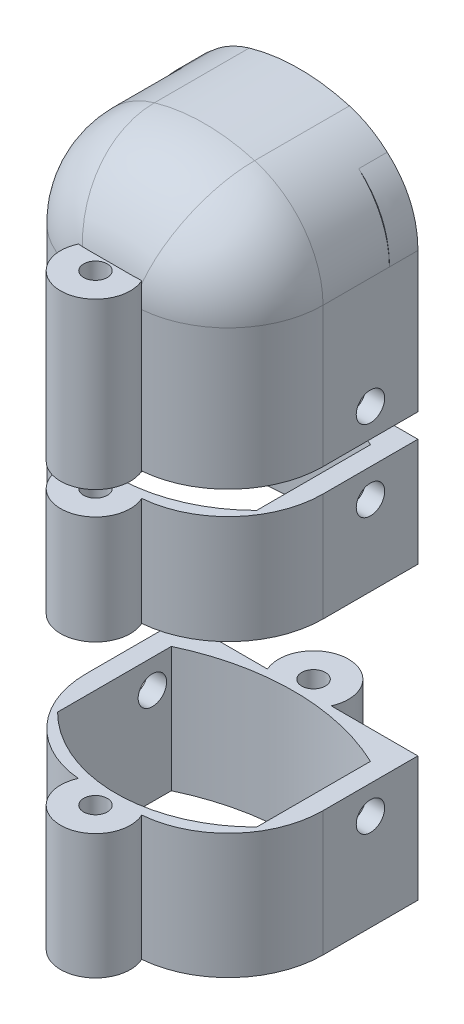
from build123d import *

# Parameters (mm, degrees)
SALIENTE_EXTRUIR1_DEPTH     = 20
REDONDEO1_R                 = 10
REDONDEO2_R                 = 10
CORTAR_EXTRUIR1_DEPTH       = 15
CORTAR_EXTRUIR2_DEPTH       = 61
CORTAR_EXTRUIR4_DEPTH       = 3
SALIENTE_EXTRUIR2_DEPTH     = 62
CROQUIS10_R                 = 1.25
CORTAR_EXTRUIR5_DEPTH       = 65
SALIENTE_EXTRUIR3_DEPTH     = 3
CORTAR_EXTRUIR6_DEPTH       = 63
CROQUIS13_R                 = 1.25
CORTAR_EXTRUIR7_DEPTH       = 63
CORTAR_EXTRUIR8_DEPTH       = 56.98446646
CORTAR_EXTRUIR8_DEPTH_BACK  = 56.98446646
CROQUIS14_W                 = 25
CROQUIS14_H                 = 2.5
CORTAR_EXTRUIR9_DEPTH       = 59.403212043
CORTAR_EXTRUIR9_DEPTH_BACK  = 59.403212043
CROQUIS15_R                 = 1.5
CORTAR_EXTRUIR10_DEPTH      = 56.984466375
CORTAR_EXTRUIR10_DEPTH_BACK = 56.984466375
CROQUIS16_W                 = 25
CROQUIS16_H                 = 15
SALIENTE_EXTRUIR4_DEPTH     = 18
SALIENTE_EXTRUIR5_DEPTH     = 62
CORTAR_EXTRUIR11_DEPTH      = 30
CORTAR_EXTRUIR11_DEPTH_BACK = 38
CROQUIS19_W                 = 25
CROQUIS19_H                 = 2.5
CROQUIS19_H_2               = 17.5


with BuildPart() as part:
    # Croquis1 → Saliente-Extruir1 (new body)
    with BuildSketch(Plane.XY):
        with BuildLine():
            Line((-18.668122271, -47.5), (6.331877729, -47.5))
            Line((6.331877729, -47.5), (6.331877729, 17.5))
            ThreePointArc((6.331877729, 17.5), (-6.168122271, 22.197977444), (-18.668122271, 17.5))
            Line((-18.668122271, 17.5), (-18.668122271, -47.5))
        make_face()
    extrude(amount=SALIENTE_EXTRUIR1_DEPTH)

    # Redondeo1
    redondeo1_edges = [part.edges().sort_by_distance(p)[0] for p in [
        (6.331877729, 17.5, 10),
        (-18.668122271, 17.5, 10),
    ]]
    fillet(redondeo1_edges, radius=REDONDEO1_R)

    # Redondeo2
    redondeo2_edges = [part.edges().sort_by_distance(p)[0] for p in [
        (-18.668122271, -17.828548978, 20),
        (6.331877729, -17.828548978, 20),
        (-6.168122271, 22.197977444, 20),
        (4.32701188, 17.849384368, 20),
        (-16.663256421, 17.849384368, 20),
    ]]
    fillet(redondeo2_edges, radius=REDONDEO2_R)

    # Croquis4 → Cortar-Extruir1 (cut)
    with BuildSketch(Plane(origin=(0, 0, 0), x_dir=(-1, 0, 0), z_dir=(0, 0, -1))):
        with BuildLine():
            Line((-4.331877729, 12.5), (-4.331877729, -47.5))
            Line((-4.331877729, -47.5), (16.668122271, -47.5))
            Line((16.668122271, -47.5), (16.668122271, 12.5))
            ThreePointArc((16.668122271, 12.5), (6.168122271, 20.269249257), (-4.331877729, 12.5))
        make_face()
    extrude(amount=-CORTAR_EXTRUIR1_DEPTH, mode=Mode.SUBTRACT)

    # Croquis5 → Cortar-Extruir2 (cut)
    with BuildSketch(Plane.XZ.offset(47.5)):
        with BuildLine():
            Line((-16.668122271, 15), (4.331877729, 15))
            ThreePointArc((4.331877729, 15), (-6.168122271, 19.349242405), (-16.668122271, 15))
        make_face()
    extrude(amount=-CORTAR_EXTRUIR2_DEPTH, mode=Mode.SUBTRACT)

    # Croquis7 → Cortar-Extruir4 (cut)
    with BuildSketch(Plane.XZ.offset(-13.5)):
        with BuildLine():
            Line((-15.022768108, 15), (3.434803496, 15))
            ThreePointArc((3.434803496, 15), (-5.793982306, 18.822688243), (-15.022768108, 15))
        make_face()
    extrude(amount=-CORTAR_EXTRUIR4_DEPTH, mode=Mode.SUBTRACT)

    # Croquis9 → Saliente-Extruir2 (add)
    with BuildSketch(Plane.XZ.offset(47.5)):
        with BuildLine():
            Line((-7.668122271, 21.5), (-8.668122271, 20))
            Line((-8.668122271, 20), (-3.668122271, 20))
            Line((-3.668122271, 20), (-4.668122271, 21.5))
            ThreePointArc((-4.668122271, 21.5), (-6.168122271, 23), (-7.668122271, 21.5))
        make_face()
        with BuildLine():
            Line((-3.668122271, 0), (-8.668122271, 0))
            Line((-8.668122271, 0), (-7.668122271, -1.5))
            ThreePointArc((-7.668122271, -1.5), (-6.168122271, -3), (-4.668122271, -1.5))
            Line((-4.668122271, -1.5), (-3.668122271, 0))
        make_face()
    extrude(amount=-SALIENTE_EXTRUIR2_DEPTH)


with BuildPart() as saliente_extruir2_piece_1:
    # of the separate pieces the step leaves, piece 1, a body of its own (saliente_extruir2_pieces)
    add(part.part.solids().sort_by_distance((-0.883688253, 21.447428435, 10))[0])

    # Croquis10 → Cortar-Extruir5 (cut)
    with BuildSketch(Plane.XZ.offset(47.5)):
        with Locations(Location((-6.168122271, 21.5, 0), (0, 0, 270))):
            Circle(CROQUIS10_R)
    extrude(amount=-CORTAR_EXTRUIR5_DEPTH, mode=Mode.SUBTRACT)

    # Croquis11 → Saliente-Extruir3 (add)
    with BuildSketch(Plane(origin=(0, 0, 0), x_dir=(-1, 0, 0), z_dir=(0, 0, -1))):
        with BuildLine():
            Line((-6.331877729, -47.5), (18.668122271, -47.5))
            Line((18.668122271, -47.5), (18.668122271, 11.842902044))
            add(Edge.make_bspline(
                [(18.668122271, 11.842902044), (19.034865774, 19.271903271), (11.965799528, 21.964053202), (6.168122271, 22.197977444)],
                knots=[0, 0, 0, 0, 1, 1, 1, 1], degree=3))
            ThreePointArc((6.168122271, 22.197977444), (5.416086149, 22.175730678), (4.666680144, 22.109068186))
            add(Edge.make_bspline(
                [(-6.331877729, 11.842902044), (-6.378371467, 18.298642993), (-1.082713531, 21.81053419), (4.666680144, 22.109068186)],
                knots=[0, 0, 0, 0, 0.484713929, 0.484713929, 0.484713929, 0.484713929], degree=3))
            Line((-6.331877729, 11.842902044), (-6.331877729, -47.5))
        make_face()
    extrude(amount=-SALIENTE_EXTRUIR3_DEPTH)

    # Croquis12 → Cortar-Extruir6 (cut)
    with BuildSketch(Plane.XZ.offset(47.5)):
        with BuildLine():
            Line((-16.668122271, 3), (4.331877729, 3))
            ThreePointArc((4.331877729, 3), (-6.168122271, 0.626351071), (-16.668122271, 3))
        make_face()
    extrude(amount=-CORTAR_EXTRUIR6_DEPTH, mode=Mode.SUBTRACT)


with BuildPart() as saliente_extruir2_piece_2:
    # of the separate pieces the step leaves, piece 2, a body of its own (saliente_extruir2_pieces)
    add(part.part.solids().sort_by_distance((-7.668122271, -47.5, -1.5))[0])

    # Croquis13 → Cortar-Extruir7 (cut)
    with BuildSketch(Plane.XZ.offset(47.5)):
        with Locations(Location((-6.168122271, -1.5, 0), (0, 0, 270))):
            Circle(CROQUIS13_R)
    extrude(amount=-CORTAR_EXTRUIR7_DEPTH, mode=Mode.SUBTRACT)


with BuildPart() as cortar_extruir8_tool:
    # Croquis14 → Cortar-Extruir8 (new, two sides: drawn at the far end of the back side and taken through both)
    with BuildSketch(Plane.XY.offset(-CORTAR_EXTRUIR8_DEPTH_BACK)):
        with Locations((-6.168122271, -4.142968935)):
            Rectangle(CROQUIS14_W, CROQUIS14_H)
        with Locations((-6.168122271, -33.065170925)):
            Rectangle(CROQUIS14_W, CROQUIS14_H)
    extrude(amount=CORTAR_EXTRUIR8_DEPTH + CORTAR_EXTRUIR8_DEPTH_BACK)


with BuildPart() as saliente_extruir2_piece_1_1:
    add(saliente_extruir2_piece_1.part)

    # Cortar-Extruir8: cut by cortar_extruir8_tool
    add(cortar_extruir8_tool.part, mode=Mode.SUBTRACT)


with BuildPart() as saliente_extruir2_piece_2_1:
    add(saliente_extruir2_piece_2.part)

    # Cortar-Extruir8: cut by cortar_extruir8_tool
    add(cortar_extruir8_tool.part, mode=Mode.SUBTRACT)


with BuildPart() as cortar_extruir8_piece_1:
    # of the separate pieces the step leaves, piece 1, a body of its own (cortar_extruir8_pieces)
    add(saliente_extruir2_piece_1_1.part.solids().sort_by_distance((-0.883688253, 21.447428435, 10))[0])


with BuildPart() as cortar_extruir8_piece_2:
    # of the separate pieces the step leaves, piece 2, a body of its own (cortar_extruir8_pieces)
    add(saliente_extruir2_piece_1_1.part.solids().sort_by_distance((6.331877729, -31.815170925, 0))[0])


with BuildPart() as cortar_extruir8_piece_3:
    # of the separate pieces the step leaves, piece 3, a body of its own (cortar_extruir8_pieces)
    add(saliente_extruir2_piece_1_1.part.solids().sort_by_distance((6.331877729, -47.5, 0))[0])


with BuildPart() as cortar_extruir8_piece_1_of_saliente_extr:
    # of the separate pieces the step leaves, piece 1, a body of its own (cortar_extruir8_pieces_of_saliente_extru)
    add(saliente_extruir2_piece_2_1.part.solids().sort_by_distance((-7.668122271, -31.815170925, -1.5))[0])


with BuildPart() as cortar_extruir8_piece_2_of_saliente_extr:
    # of the separate pieces the step leaves, piece 2, a body of its own (cortar_extruir8_pieces_of_saliente_extru)
    add(saliente_extruir2_piece_2_1.part.solids().sort_by_distance((-7.668122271, -2.892968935, -1.5))[0])


with BuildPart() as cortar_extruir8_piece_3_of_saliente_extr:
    # of the separate pieces the step leaves, piece 3, a body of its own (cortar_extruir8_pieces_of_saliente_extru)
    add(saliente_extruir2_piece_2_1.part.solids().sort_by_distance((-7.668122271, -47.5, -1.5))[0])


with BuildPart() as cortar_extruir9_tool:
    # Croquis15 → Cortar-Extruir9 (new, two sides: drawn at the far end of the back side and taken through both)
    with BuildSketch(Plane(origin=(6.331877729, 0, 0), x_dir=(0, 0, -1), z_dir=(1, 0, 0)).offset(-CORTAR_EXTRUIR9_DEPTH_BACK)):
        with Locations((-5, 0.107031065)):
            Circle(CROQUIS15_R)
        with Locations((-5, -8.392968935)):
            Circle(CROQUIS15_R)
        with Locations((-5, -28.815170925)):
            Circle(CROQUIS15_R)
        with Locations((-5, -37.315170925)):
            Circle(CROQUIS15_R)
    extrude(amount=CORTAR_EXTRUIR9_DEPTH + CORTAR_EXTRUIR9_DEPTH_BACK)


with BuildPart() as cortar_extruir8_piece_1_1:
    add(cortar_extruir8_piece_1.part)

    # Cortar-Extruir9: cut by cortar_extruir9_tool
    add(cortar_extruir9_tool.part, mode=Mode.SUBTRACT)

    # Croquis17 → Saliente-Extruir4 (add)
    with BuildSketch(Plane.XZ.offset(-16.5)):
        with BuildLine():
            Line((-15.022768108, 15), (3.434803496, 15))
            ThreePointArc((3.434803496, 15), (-5.793982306, 18.822688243), (-15.022768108, 15))
        make_face()
    extrude(amount=SALIENTE_EXTRUIR4_DEPTH)



with BuildPart() as cortar_extruir8_piece_2_1:
    add(cortar_extruir8_piece_2.part)

    # Cortar-Extruir9: cut by cortar_extruir9_tool
    add(cortar_extruir9_tool.part, mode=Mode.SUBTRACT)


with BuildPart() as cortar_extruir8_piece_3_1:
    add(cortar_extruir8_piece_3.part)

    # Cortar-Extruir9: cut by cortar_extruir9_tool
    add(cortar_extruir9_tool.part, mode=Mode.SUBTRACT)


with BuildPart() as cortar_extruir10_tool:
    # Croquis16 → Cortar-Extruir10 (new, two sides: drawn at the far end of the back side and taken through both)
    with BuildSketch(Plane(origin=(0, 0, 0), x_dir=(-1, 0, 0), z_dir=(0, 0, -1)).offset(-CORTAR_EXTRUIR10_DEPTH_BACK)):
        with Locations((6.168122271, -24.315170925)):
            Rectangle(CROQUIS16_W, CROQUIS16_H)
    extrude(amount=CORTAR_EXTRUIR10_DEPTH + CORTAR_EXTRUIR10_DEPTH_BACK)


with BuildPart() as cortar_extruir8_piece_2_2:
    add(cortar_extruir8_piece_2_1.part)

    # Cortar-Extruir10: cut by cortar_extruir10_tool
    add(cortar_extruir10_tool.part, mode=Mode.SUBTRACT)


with BuildPart() as cortar_extruir8_piece_1_of_saliente_extr_1:
    add(cortar_extruir8_piece_1_of_saliente_extr.part)

    # Cortar-Extruir10: cut by cortar_extruir10_tool
    add(cortar_extruir10_tool.part, mode=Mode.SUBTRACT)


with BuildPart() as cortar_extruir8_piece_1_2:
    add(cortar_extruir8_piece_1_1.part)

    add(cortar_extruir8_piece_2_2.part)  # Saliente-Extruir5 merges Cortar-Extruir8 piece 2

    add(cortar_extruir8_piece_3_1.part)  # Saliente-Extruir5 merges Cortar-Extruir8 piece 3

    add(cortar_extruir8_piece_1_of_saliente_extr_1.part)  # Saliente-Extruir5 merges Cortar-Extruir8 piece 1 of Saliente-Extr

    add(cortar_extruir8_piece_2_of_saliente_extr.part)  # Saliente-Extruir5 merges Cortar-Extruir8 piece 2 of Saliente-Extr

    add(cortar_extruir8_piece_3_of_saliente_extr.part)  # Saliente-Extruir5 merges Cortar-Extruir8 piece 3 of Saliente-Extr
    # Croquis18 → Saliente-Extruir5 (add)
    with BuildSketch(Plane.XZ.offset(47.5)):
        with BuildLine():
            Line((-9.512140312, 19.964318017), (-8.668122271, 20))
            Line((-8.668122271, 20), (-7.668122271, 21.5))
            ThreePointArc((-7.668122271, 21.5), (-6.168122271, 23), (-4.668122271, 21.5))
            Line((-4.668122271, 21.5), (-3.668122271, 20))
            Line((-3.668122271, 20), (-2.82410423, 19.964318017))
            ThreePointArc((-2.82410423, 19.964318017), (-6.168122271, 25.179779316), (-9.512140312, 19.964318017))
        make_face()
        with BuildLine():
            Line((-9.512140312, 0.035681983), (-8.668122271, 0))
            Line((-8.668122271, 0), (-7.668122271, -1.5))
            ThreePointArc((-7.668122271, -1.5), (-6.168122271, -3), (-4.668122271, -1.5))
            Line((-4.668122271, -1.5), (-3.668122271, 0))
            Line((-3.668122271, 0), (-2.82410423, 0.035681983))
            ThreePointArc((-2.82410423, 0.035681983), (-6.168122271, -5.179779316), (-9.512140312, 0.035681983))
        make_face()
    extrude(amount=-SALIENTE_EXTRUIR5_DEPTH)

    # Croquis19 → Cortar-Extruir11 (cut, two sides: drawn at the far end of the back side and taken through both)
    with BuildSketch(Plane(origin=(0, 0, 15), x_dir=(-1, 0, 0), z_dir=(0, 0, -1)).offset(-CORTAR_EXTRUIR11_DEPTH_BACK)):
        with Locations((6.168122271, -4.142968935)):
            Rectangle(CROQUIS19_W, CROQUIS19_H)
        with Locations((6.168122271, -25.565170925)):
            Rectangle(CROQUIS19_W, CROQUIS19_H_2)
    extrude(amount=CORTAR_EXTRUIR11_DEPTH + CORTAR_EXTRUIR11_DEPTH_BACK, mode=Mode.SUBTRACT)


with BuildPart() as cortar_extruir11_piece_1:
    # of the separate pieces the step leaves, piece 1, a body of its own (cortar_extruir11_pieces)
    add(cortar_extruir8_piece_1_2.part.solids().sort_by_distance((-2.82410423, -2.892968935, 19.964318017))[0])


with BuildPart() as cortar_extruir11_piece_2:
    # of the separate pieces the step leaves, piece 2, a body of its own (cortar_extruir11_pieces)
    add(cortar_extruir8_piece_1_2.part.solids().sort_by_distance((-6.168122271, -47.5, -2.75))[0])


with BuildPart() as cortar_extruir11_piece_3:
    # of the separate pieces the step leaves, piece 3, a body of its own (cortar_extruir11_pieces)
    add(cortar_extruir8_piece_1_2.part.solids().sort_by_distance((-2.82410423, -16.815170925, 19.964318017))[0])


solid = Compound([cortar_extruir11_piece_1.part, cortar_extruir11_piece_2.part, cortar_extruir11_piece_3.part])
